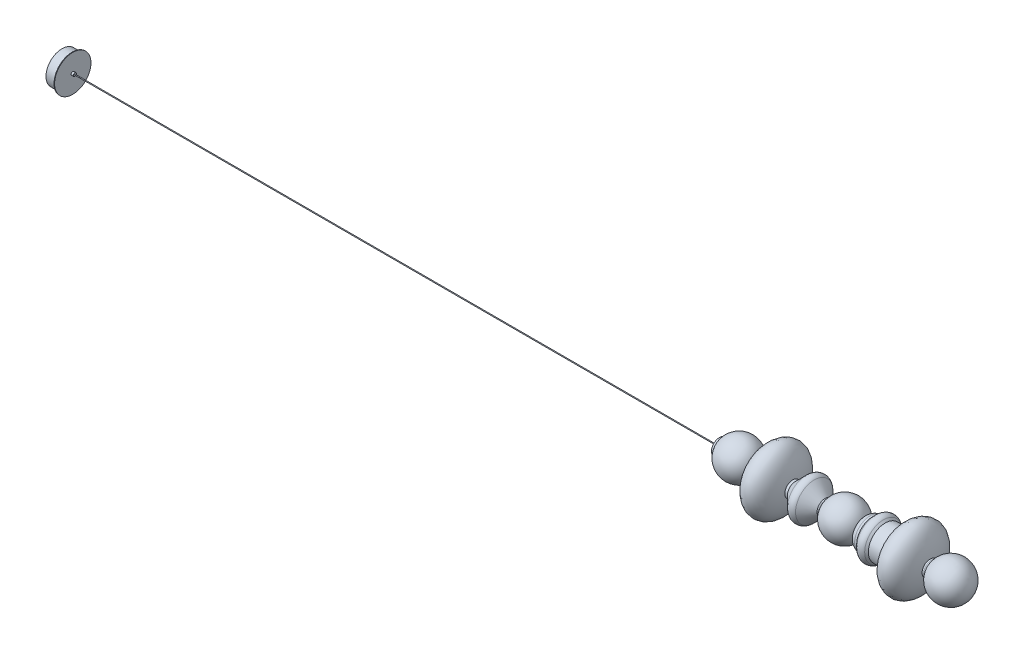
ISO-10303-21;
HEADER;
FILE_DESCRIPTION(('STEP AP214'),'2;1');
FILE_NAME('part.step','',(''),(''),'','','');
FILE_SCHEMA(('AUTOMOTIVE_DESIGN { 1 0 10303 214 1 1 1 1 }'));
ENDSEC;
DATA;
#1=APPLICATION_CONTEXT('core data for automotive mechanical design processes');
#2=APPLICATION_PROTOCOL_DEFINITION('international standard','automotive_design',2000,#1);
#3=PRODUCT_CONTEXT('',#1,'mechanical');
#4=PRODUCT('Part','Part','',(#3));
#5=PRODUCT_RELATED_PRODUCT_CATEGORY('part','',(#4));
#6=PRODUCT_DEFINITION_FORMATION('','',#4);
#7=PRODUCT_DEFINITION_CONTEXT('part definition',#1,'design');
#8=PRODUCT_DEFINITION('design','',#6,#7);
#9=PRODUCT_DEFINITION_SHAPE('','',#8);
#10=(LENGTH_UNIT() NAMED_UNIT(*) SI_UNIT(.MILLI.,.METRE.));
#11=(NAMED_UNIT(*) PLANE_ANGLE_UNIT() SI_UNIT($,.RADIAN.));
#12=(NAMED_UNIT(*) SI_UNIT($,.STERADIAN.) SOLID_ANGLE_UNIT());
#13=UNCERTAINTY_MEASURE_WITH_UNIT(LENGTH_MEASURE(1.E-05),#10,'distance_accuracy_value','');
#14=(GEOMETRIC_REPRESENTATION_CONTEXT(3) GLOBAL_UNCERTAINTY_ASSIGNED_CONTEXT((#13)) GLOBAL_UNIT_ASSIGNED_CONTEXT((#10,
#11,#12)) REPRESENTATION_CONTEXT('',''));
#15=CARTESIAN_POINT('',(0.,0.,0.));
#16=DIRECTION('',(0.,0.,1.));
#17=DIRECTION('',(1.,0.,0.));
#18=AXIS2_PLACEMENT_3D('',#15,#16,#17);
#19=CARTESIAN_POINT('',(-585.624200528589,0.,0.));
#20=DIRECTION('',(1.,0.,0.));
#21=DIRECTION('',(0.,0.,-1.));
#22=AXIS2_PLACEMENT_3D('',#19,#20,#21);
#23=PLANE('',#22);
#24=CARTESIAN_POINT('',(-585.624200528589,0.,0.));
#25=DIRECTION('',(-1.,0.,0.));
#26=DIRECTION('',(0.,0.,1.));
#27=AXIS2_PLACEMENT_3D('',#24,#25,#26);
#28=CIRCLE('',#27,6.);
#29=CARTESIAN_POINT('',(-585.624200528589,0.,6.));
#30=VERTEX_POINT('',#29);
#31=EDGE_CURVE('E66',#30,#30,#28,.T.);
#32=ORIENTED_EDGE('',*,*,#31,.F.);
#33=EDGE_LOOP('',(#32));
#34=FACE_BOUND('',#33,.T.);
#35=CARTESIAN_POINT('',(-585.624200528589,0.,0.));
#36=DIRECTION('',(-1.,0.,0.));
#37=DIRECTION('',(0.,0.,1.));
#38=AXIS2_PLACEMENT_3D('',#35,#36,#37);
#39=CIRCLE('',#38,37.);
#40=CARTESIAN_POINT('',(-585.624200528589,0.,37.));
#41=VERTEX_POINT('',#40);
#42=EDGE_CURVE('E57',#41,#41,#39,.T.);
#43=ORIENTED_EDGE('',*,*,#42,.T.);
#44=EDGE_LOOP('',(#43));
#45=FACE_BOUND('',#44,.T.);
#46=ADVANCED_FACE('F54',(#34,#45),#23,.F.);
#47=CARTESIAN_POINT('',(-986.248401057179,0.,0.));
#48=DIRECTION('',(-1.,0.,0.));
#49=DIRECTION('',(0.,0.,1.));
#50=AXIS2_PLACEMENT_3D('',#47,#48,#49);
#51=CYLINDRICAL_SURFACE('',#50,37.);
#52=ORIENTED_EDGE('',*,*,#42,.F.);
#53=EDGE_LOOP('',(#52));
#54=FACE_BOUND('',#53,.T.);
#55=CARTESIAN_POINT('',(-575.624200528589,0.,0.));
#56=DIRECTION('',(-1.,0.,0.));
#57=DIRECTION('',(0.,0.,1.));
#58=AXIS2_PLACEMENT_3D('',#55,#56,#57);
#59=CIRCLE('',#58,37.);
#60=CARTESIAN_POINT('',(-575.624200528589,0.,37.));
#61=VERTEX_POINT('',#60);
#62=EDGE_CURVE('E89',#61,#61,#59,.T.);
#63=ORIENTED_EDGE('',*,*,#62,.T.);
#64=EDGE_LOOP('',(#63));
#65=FACE_BOUND('',#64,.T.);
#66=ADVANCED_FACE('F98',(#54,#65),#51,.T.);
#67=CARTESIAN_POINT('',(-575.624200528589,0.,0.));
#68=DIRECTION('',(-1.,0.,0.));
#69=DIRECTION('',(0.,0.,1.));
#70=AXIS2_PLACEMENT_3D('',#67,#68,#69);
#71=PLANE('',#70);
#72=ORIENTED_EDGE('',*,*,#62,.F.);
#73=EDGE_LOOP('',(#72));
#74=FACE_BOUND('',#73,.T.);
#75=ADVANCED_FACE('F100',(#74),#71,.F.);
#76=CARTESIAN_POINT('',(-595.624200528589,0.,0.));
#77=DIRECTION('',(1.,0.,0.));
#78=DIRECTION('',(0.,0.,-1.));
#79=AXIS2_PLACEMENT_3D('',#76,#77,#78);
#80=CYLINDRICAL_SURFACE('',#79,6.);
#81=CARTESIAN_POINT('',(-595.624200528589,0.,0.));
#82=DIRECTION('',(-1.,0.,0.));
#83=DIRECTION('',(0.,0.,1.));
#84=AXIS2_PLACEMENT_3D('',#81,#82,#83);
#85=CIRCLE('',#84,6.);
#86=CARTESIAN_POINT('',(-595.624200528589,0.,6.));
#87=VERTEX_POINT('',#86);
#88=EDGE_CURVE('E85',#87,#87,#85,.T.);
#89=ORIENTED_EDGE('',*,*,#88,.F.);
#90=EDGE_LOOP('',(#89));
#91=FACE_BOUND('',#90,.T.);
#92=ORIENTED_EDGE('',*,*,#31,.T.);
#93=EDGE_LOOP('',(#92));
#94=FACE_BOUND('',#93,.T.);
#95=ADVANCED_FACE('F105',(#91,#94),#80,.T.);
#96=CARTESIAN_POINT('',(-595.624200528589,0.,0.));
#97=DIRECTION('',(-1.,0.,0.));
#98=DIRECTION('',(0.,0.,1.));
#99=AXIS2_PLACEMENT_3D('',#96,#97,#98);
#100=PLANE('',#99);
#101=CARTESIAN_POINT('',(-595.624200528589,0.,0.));
#102=DIRECTION('',(-1.,0.,0.));
#103=DIRECTION('',(0.,0.,1.));
#104=AXIS2_PLACEMENT_3D('',#101,#102,#103);
#105=CIRCLE('',#104,1.75);
#106=CARTESIAN_POINT('',(-595.624200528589,0.,1.75));
#107=VERTEX_POINT('',#106);
#108=EDGE_CURVE('E61',#107,#107,#105,.T.);
#109=ORIENTED_EDGE('',*,*,#108,.F.);
#110=EDGE_LOOP('',(#109));
#111=FACE_BOUND('',#110,.T.);
#112=ORIENTED_EDGE('',*,*,#88,.T.);
#113=EDGE_LOOP('',(#112));
#114=FACE_BOUND('',#113,.T.);
#115=ADVANCED_FACE('F112',(#111,#114),#100,.T.);
#116=CARTESIAN_POINT('',(-3595.62420052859,0.,0.));
#117=DIRECTION('',(1.,0.,0.));
#118=DIRECTION('',(0.,0.,-1.));
#119=AXIS2_PLACEMENT_3D('',#116,#117,#118);
#120=CYLINDRICAL_SURFACE('',#119,1.75);
#121=CARTESIAN_POINT('',(-3595.62420052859,0.,0.));
#122=DIRECTION('',(-1.,0.,0.));
#123=DIRECTION('',(0.,0.,1.));
#124=AXIS2_PLACEMENT_3D('',#121,#122,#123);
#125=CIRCLE('',#124,1.75);
#126=CARTESIAN_POINT('',(-3595.62420052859,0.,1.75));
#127=VERTEX_POINT('',#126);
#128=EDGE_CURVE('E81',#127,#127,#125,.T.);
#129=ORIENTED_EDGE('',*,*,#128,.F.);
#130=EDGE_LOOP('',(#129));
#131=FACE_BOUND('',#130,.T.);
#132=ORIENTED_EDGE('',*,*,#108,.T.);
#133=EDGE_LOOP('',(#132));
#134=FACE_BOUND('',#133,.T.);
#135=ADVANCED_FACE('F116',(#131,#134),#120,.T.);
#136=CARTESIAN_POINT('',(-3605.62420052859,0.,0.));
#137=DIRECTION('',(1.,0.,0.));
#138=DIRECTION('',(0.,0.,-1.));
#139=AXIS2_PLACEMENT_3D('',#136,#137,#138);
#140=CYLINDRICAL_SURFACE('',#139,7.5);
#141=CARTESIAN_POINT('',(-3605.62420052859,0.,0.));
#142=DIRECTION('',(-1.,0.,0.));
#143=DIRECTION('',(0.,0.,1.));
#144=AXIS2_PLACEMENT_3D('',#141,#142,#143);
#145=CIRCLE('',#144,7.5);
#146=CARTESIAN_POINT('',(-3605.62420052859,0.,7.5));
#147=VERTEX_POINT('',#146);
#148=EDGE_CURVE('E78',#147,#147,#145,.T.);
#149=ORIENTED_EDGE('',*,*,#148,.F.);
#150=EDGE_LOOP('',(#149));
#151=FACE_BOUND('',#150,.T.);
#152=CARTESIAN_POINT('',(-3595.62420052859,0.,0.));
#153=DIRECTION('',(-1.,0.,0.));
#154=DIRECTION('',(0.,0.,1.));
#155=AXIS2_PLACEMENT_3D('',#152,#153,#154);
#156=CIRCLE('',#155,7.5);
#157=CARTESIAN_POINT('',(-3595.62420052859,0.,7.5));
#158=VERTEX_POINT('',#157);
#159=EDGE_CURVE('E74',#158,#158,#156,.T.);
#160=ORIENTED_EDGE('',*,*,#159,.T.);
#161=EDGE_LOOP('',(#160));
#162=FACE_BOUND('',#161,.T.);
#163=ADVANCED_FACE('F120',(#151,#162),#140,.T.);
#164=CARTESIAN_POINT('',(-3595.62420052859,0.,0.));
#165=DIRECTION('',(-1.,0.,0.));
#166=DIRECTION('',(0.,0.,1.));
#167=AXIS2_PLACEMENT_3D('',#164,#165,#166);
#168=PLANE('',#167);
#169=ORIENTED_EDGE('',*,*,#128,.T.);
#170=EDGE_LOOP('',(#169));
#171=FACE_BOUND('',#170,.T.);
#172=ORIENTED_EDGE('',*,*,#159,.F.);
#173=EDGE_LOOP('',(#172));
#174=FACE_BOUND('',#173,.T.);
#175=ADVANCED_FACE('F124',(#171,#174),#168,.F.);
#176=CARTESIAN_POINT('',(-3608.16420052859,0.,0.));
#177=DIRECTION('',(1.,0.,0.));
#178=DIRECTION('',(0.,0.,-1.));
#179=AXIS2_PLACEMENT_3D('',#176,#177,#178);
#180=CYLINDRICAL_SURFACE('',#179,84.963);
#181=CARTESIAN_POINT('',(-3608.16420052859,0.,0.));
#182=DIRECTION('',(-1.,0.,0.));
#183=DIRECTION('',(0.,0.,1.));
#184=AXIS2_PLACEMENT_3D('',#181,#182,#183);
#185=CIRCLE('',#184,84.963);
#186=CARTESIAN_POINT('',(-3608.16420052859,0.,84.963));
#187=VERTEX_POINT('',#186);
#188=EDGE_CURVE('E71',#187,#187,#185,.T.);
#189=ORIENTED_EDGE('',*,*,#188,.F.);
#190=EDGE_LOOP('',(#189));
#191=FACE_BOUND('',#190,.T.);
#192=CARTESIAN_POINT('',(-3605.62420052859,0.,0.));
#193=DIRECTION('',(-1.,0.,0.));
#194=DIRECTION('',(0.,0.,1.));
#195=AXIS2_PLACEMENT_3D('',#192,#193,#194);
#196=CIRCLE('',#195,84.963);
#197=CARTESIAN_POINT('',(-3605.62420052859,0.,84.963));
#198=VERTEX_POINT('',#197);
#199=EDGE_CURVE('E75',#198,#198,#196,.T.);
#200=ORIENTED_EDGE('',*,*,#199,.T.);
#201=EDGE_LOOP('',(#200));
#202=FACE_BOUND('',#201,.T.);
#203=ADVANCED_FACE('F128',(#191,#202),#180,.T.);
#204=CARTESIAN_POINT('',(-3608.16420052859,0.,0.));
#205=DIRECTION('',(-1.,0.,0.));
#206=DIRECTION('',(0.,0.,1.));
#207=AXIS2_PLACEMENT_3D('',#204,#205,#206);
#208=PLANE('',#207);
#209=CARTESIAN_POINT('',(-3608.16420052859,0.,0.));
#210=DIRECTION('',(-1.,0.,0.));
#211=DIRECTION('',(0.,0.,1.));
#212=AXIS2_PLACEMENT_3D('',#209,#210,#211);
#213=CIRCLE('',#212,75.057);
#214=CARTESIAN_POINT('',(-3608.16420052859,0.,-75.057));
#215=VERTEX_POINT('',#214);
#216=EDGE_CURVE('E11',#215,#215,#213,.T.);
#217=ORIENTED_EDGE('',*,*,#216,.F.);
#218=EDGE_LOOP('',(#217));
#219=FACE_BOUND('',#218,.T.);
#220=ORIENTED_EDGE('',*,*,#188,.T.);
#221=EDGE_LOOP('',(#220));
#222=FACE_BOUND('',#221,.T.);
#223=ADVANCED_FACE('F132',(#219,#222),#208,.T.);
#224=CARTESIAN_POINT('',(-3605.62420052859,0.,0.));
#225=DIRECTION('',(-1.,0.,0.));
#226=DIRECTION('',(0.,0.,1.));
#227=AXIS2_PLACEMENT_3D('',#224,#225,#226);
#228=PLANE('',#227);
#229=ORIENTED_EDGE('',*,*,#148,.T.);
#230=EDGE_LOOP('',(#229));
#231=FACE_BOUND('',#230,.T.);
#232=ORIENTED_EDGE('',*,*,#199,.F.);
#233=EDGE_LOOP('',(#232));
#234=FACE_BOUND('',#233,.T.);
#235=ADVANCED_FACE('F134',(#231,#234),#228,.F.);
#236=CARTESIAN_POINT('',(-3655.66220052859,0.,0.));
#237=DIRECTION('',(1.,0.,0.));
#238=DIRECTION('',(0.,0.,-1.));
#239=AXIS2_PLACEMENT_3D('',#236,#237,#238);
#240=CYLINDRICAL_SURFACE('',#239,75.057);
#241=CARTESIAN_POINT('',(-3655.66220052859,0.,0.));
#242=DIRECTION('',(-1.,0.,0.));
#243=DIRECTION('',(0.,0.,1.));
#244=AXIS2_PLACEMENT_3D('',#241,#242,#243);
#245=CIRCLE('',#244,75.057);
#246=CARTESIAN_POINT('',(-3655.66220052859,0.,-75.057));
#247=VERTEX_POINT('',#246);
#248=EDGE_CURVE('E70',#247,#247,#245,.T.);
#249=CARTESIAN_POINT('',(-3655.66220052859,0.,-75.057));
#250=CARTESIAN_POINT('',(-3655.16742969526,0.,-75.057));
#251=CARTESIAN_POINT('',(-3654.67265886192,0.,-75.057));
#252=CARTESIAN_POINT('',(-3653.68311719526,0.,-75.057));
#253=CARTESIAN_POINT('',(-3653.18834636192,0.,-75.057));
#254=CARTESIAN_POINT('',(-3652.19880469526,0.,-75.057));
#255=CARTESIAN_POINT('',(-3651.70403386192,0.,-75.057));
#256=CARTESIAN_POINT('',(-3650.71449219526,0.,-75.057));
#257=CARTESIAN_POINT('',(-3650.21972136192,0.,-75.057));
#258=CARTESIAN_POINT('',(-3649.23017969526,0.,-75.057));
#259=CARTESIAN_POINT('',(-3648.73540886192,0.,-75.057));
#260=CARTESIAN_POINT('',(-3647.74586719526,0.,-75.057));
#261=CARTESIAN_POINT('',(-3647.25109636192,0.,-75.057));
#262=CARTESIAN_POINT('',(-3646.26155469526,0.,-75.057));
#263=CARTESIAN_POINT('',(-3645.76678386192,0.,-75.057));
#264=CARTESIAN_POINT('',(-3644.77724219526,0.,-75.057));
#265=CARTESIAN_POINT('',(-3644.28247136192,0.,-75.057));
#266=CARTESIAN_POINT('',(-3643.29292969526,0.,-75.057));
#267=CARTESIAN_POINT('',(-3642.79815886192,0.,-75.057));
#268=CARTESIAN_POINT('',(-3641.80861719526,0.,-75.057));
#269=CARTESIAN_POINT('',(-3641.31384636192,0.,-75.057));
#270=CARTESIAN_POINT('',(-3640.32430469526,0.,-75.057));
#271=CARTESIAN_POINT('',(-3639.82953386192,0.,-75.057));
#272=CARTESIAN_POINT('',(-3638.83999219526,0.,-75.057));
#273=CARTESIAN_POINT('',(-3638.34522136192,0.,-75.057));
#274=CARTESIAN_POINT('',(-3637.35567969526,0.,-75.057));
#275=CARTESIAN_POINT('',(-3636.86090886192,0.,-75.057));
#276=CARTESIAN_POINT('',(-3635.87136719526,0.,-75.057));
#277=CARTESIAN_POINT('',(-3635.37659636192,0.,-75.057));
#278=CARTESIAN_POINT('',(-3634.38705469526,0.,-75.057));
#279=CARTESIAN_POINT('',(-3633.89228386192,0.,-75.057));
#280=CARTESIAN_POINT('',(-3632.90274219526,0.,-75.057));
#281=CARTESIAN_POINT('',(-3632.40797136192,0.,-75.057));
#282=CARTESIAN_POINT('',(-3631.41842969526,0.,-75.057));
#283=CARTESIAN_POINT('',(-3630.92365886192,0.,-75.057));
#284=CARTESIAN_POINT('',(-3629.93411719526,0.,-75.057));
#285=CARTESIAN_POINT('',(-3629.43934636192,0.,-75.057));
#286=CARTESIAN_POINT('',(-3628.44980469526,0.,-75.057));
#287=CARTESIAN_POINT('',(-3627.95503386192,0.,-75.057));
#288=CARTESIAN_POINT('',(-3626.96549219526,0.,-75.057));
#289=CARTESIAN_POINT('',(-3626.47072136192,0.,-75.057));
#290=CARTESIAN_POINT('',(-3625.48117969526,0.,-75.057));
#291=CARTESIAN_POINT('',(-3624.98640886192,0.,-75.057));
#292=CARTESIAN_POINT('',(-3623.99686719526,0.,-75.057));
#293=CARTESIAN_POINT('',(-3623.50209636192,0.,-75.057));
#294=CARTESIAN_POINT('',(-3622.51255469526,0.,-75.057));
#295=CARTESIAN_POINT('',(-3622.01778386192,0.,-75.057));
#296=CARTESIAN_POINT('',(-3621.02824219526,0.,-75.057));
#297=CARTESIAN_POINT('',(-3620.53347136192,0.,-75.057));
#298=CARTESIAN_POINT('',(-3619.54392969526,0.,-75.057));
#299=CARTESIAN_POINT('',(-3619.04915886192,0.,-75.057));
#300=CARTESIAN_POINT('',(-3618.05961719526,0.,-75.057));
#301=CARTESIAN_POINT('',(-3617.56484636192,0.,-75.057));
#302=CARTESIAN_POINT('',(-3616.57530469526,0.,-75.057));
#303=CARTESIAN_POINT('',(-3616.08053386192,0.,-75.057));
#304=CARTESIAN_POINT('',(-3615.09099219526,0.,-75.057));
#305=CARTESIAN_POINT('',(-3614.59622136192,0.,-75.057));
#306=CARTESIAN_POINT('',(-3613.60667969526,0.,-75.057));
#307=CARTESIAN_POINT('',(-3613.11190886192,0.,-75.057));
#308=CARTESIAN_POINT('',(-3612.12236719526,0.,-75.057));
#309=CARTESIAN_POINT('',(-3611.62759636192,0.,-75.057));
#310=CARTESIAN_POINT('',(-3610.63805469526,0.,-75.057));
#311=CARTESIAN_POINT('',(-3610.14328386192,0.,-75.057));
#312=CARTESIAN_POINT('',(-3609.15374219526,0.,-75.057));
#313=CARTESIAN_POINT('',(-3608.65897136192,0.,-75.057));
#314=CARTESIAN_POINT('',(-3608.16420052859,0.,-75.057));
#315=B_SPLINE_CURVE_WITH_KNOTS('',3,(#249,#250,#251,#252,#253,#254,#255,#256,#257,#258,#259,
#260,#261,#262,#263,#264,#265,#266,#267,#268,#269,#270,#271,#272,#273,#274,#275,#276,#277,#278,
#279,#280,#281,#282,#283,#284,#285,#286,#287,#288,#289,#290,#291,#292,#293,#294,#295,#296,#297,
#298,#299,#300,#301,#302,#303,#304,#305,#306,#307,#308,#309,#310,#311,#312,#313,#314),
.UNSPECIFIED.,.F.,.F.,(4,2,2,2,2,2,2,2,2,2,2,2,2,2,2,2,2,2,2,2,2,2,2,2,2,2,2,2,2,2,2,2,4),(0.,
1.4843124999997,2.96862499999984,4.45293749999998,5.93724999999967,7.42156249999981,
8.90587499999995,10.3901874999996,11.8744999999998,13.3588124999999,14.8431249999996,
16.3274374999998,17.8117499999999,19.2960624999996,20.7803749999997,22.2646874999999,
23.7489999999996,25.2333124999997,26.7176249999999,28.2019375,29.6862499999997,31.1705624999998,
32.654875,34.1391874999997,35.6234999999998,37.1078125,38.5921249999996,40.0764374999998,
41.5607499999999,43.0450624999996,44.5293749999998,46.0136874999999,47.4979999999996),.UNSPECIFIED.);
#316=EDGE_CURVE('BSEAM137',#247,#215,#315,.T.);
#317=ORIENTED_EDGE('',*,*,#248,.F.);
#318=ORIENTED_EDGE('',*,*,#216,.T.);
#319=ORIENTED_EDGE('',*,*,#316,.T.);
#320=ORIENTED_EDGE('',*,*,#316,.F.);
#321=EDGE_LOOP('',(#317,#319,#318,#320));
#322=FACE_BOUND('',#321,.T.);
#323=ADVANCED_FACE('F137',(#322),#240,.T.);
#324=CARTESIAN_POINT('',(-3655.66220052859,0.,0.));
#325=DIRECTION('',(-1.,0.,0.));
#326=DIRECTION('',(0.,0.,1.));
#327=AXIS2_PLACEMENT_3D('',#324,#325,#326);
#328=PLANE('',#327);
#329=ORIENTED_EDGE('',*,*,#248,.T.);
#330=EDGE_LOOP('',(#329));
#331=FACE_BOUND('',#330,.T.);
#332=ADVANCED_FACE('F144',(#331),#328,.T.);
#333=CLOSED_SHELL('',(#46,#66,#75,#95,#115,#135,#163,#175,#203,#223,#235,#323,#332));
#334=MANIFOLD_SOLID_BREP('B2',#333);
#335=CARTESIAN_POINT('',(-575.624200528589,35.9687364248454,0.));
#336=DIRECTION('',(1.,0.,0.));
#337=DIRECTION('',(0.,-1.,0.));
#338=AXIS2_PLACEMENT_3D('',#335,#336,#337);
#339=PLANE('',#338);
#340=CARTESIAN_POINT('',(-575.624200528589,0.,0.));
#341=DIRECTION('',(-1.,0.,0.));
#342=DIRECTION('',(0.,-1.,0.));
#343=AXIS2_PLACEMENT_3D('',#340,#341,#342);
#344=CIRCLE('',#343,35.9687364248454);
#345=CARTESIAN_POINT('',(-575.624200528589,35.9687364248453,0.));
#346=VERTEX_POINT('',#345);
#347=EDGE_CURVE('E53',#346,#346,#344,.T.);
#348=ORIENTED_EDGE('',*,*,#347,.T.);
#349=EDGE_LOOP('',(#348));
#350=FACE_BOUND('',#349,.T.);
#351=ADVANCED_FACE('F265',(#350),#339,.F.);
#352=CARTESIAN_POINT('',(-493.124200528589,0.,0.));
#353=DIRECTION('',(1.,0.,0.));
#354=DIRECTION('',(0.,1.,0.));
#355=AXIS2_PLACEMENT_3D('',#352,#353,#354);
#356=SPHERICAL_SURFACE('',#355,90.);
#357=CARTESIAN_POINT('',(-410.624200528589,0.,0.));
#358=DIRECTION('',(-1.,0.,0.));
#359=DIRECTION('',(0.,-1.,0.));
#360=AXIS2_PLACEMENT_3D('',#357,#358,#359);
#361=CIRCLE('',#360,35.9687364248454);
#362=CARTESIAN_POINT('',(-410.624200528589,35.9687364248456,0.));
#363=VERTEX_POINT('',#362);
#364=EDGE_CURVE('E271',#363,#363,#361,.T.);
#365=CARTESIAN_POINT('',(-410.624200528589,35.9687364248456,0.));
#366=CARTESIAN_POINT('',(-411.058686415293,36.9653219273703,0.));
#367=CARTESIAN_POINT('',(-411.511246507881,37.9540267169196,0.));
#368=CARTESIAN_POINT('',(-412.451884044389,39.9143942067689,0.));
#369=CARTESIAN_POINT('',(-412.939961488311,40.8860569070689,0.));
#370=CARTESIAN_POINT('',(-413.951002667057,42.811059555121,0.));
#371=CARTESIAN_POINT('',(-414.47396640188,43.7643995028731,0.));
#372=CARTESIAN_POINT('',(-415.554090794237,45.6515060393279,0.));
#373=CARTESIAN_POINT('',(-416.11125145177,46.5852726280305,0.));
#374=CARTESIAN_POINT('',(-417.25903876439,48.4320059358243,0.));
#375=CARTESIAN_POINT('',(-417.849665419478,49.3449726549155,0.));
#376=CARTESIAN_POINT('',(-419.063608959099,51.148907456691,0.));
#377=CARTESIAN_POINT('',(-419.686925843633,52.0398755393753,0.));
#378=CARTESIAN_POINT('',(-420.965431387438,53.7986430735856,0.));
#379=CARTESIAN_POINT('',(-421.62062004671,54.6664425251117,0.));
#380=CARTESIAN_POINT('',(-422.9620087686,56.3777332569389,0.));
#381=CARTESIAN_POINT('',(-423.648208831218,57.2212245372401,0.));
#382=CARTESIAN_POINT('',(-425.050719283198,58.8827912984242,0.));
#383=CARTESIAN_POINT('',(-425.767029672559,59.7008667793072,0.));
#384=CARTESIAN_POINT('',(-427.228820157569,61.3105276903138,0.));
#385=CARTESIAN_POINT('',(-427.974300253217,62.1021131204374,0.));
#386=CARTESIAN_POINT('',(-429.493451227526,63.6577544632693,0.));
#387=CARTESIAN_POINT('',(-430.267122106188,64.4218103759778,0.));
#388=CARTESIAN_POINT('',(-431.841638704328,65.9213893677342,0.));
#389=CARTESIAN_POINT('',(-432.642484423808,66.6569124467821,0.));
#390=CARTESIAN_POINT('',(-434.27029907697,68.0984599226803,0.));
#391=CARTESIAN_POINT('',(-435.097268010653,68.8044843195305,0.));
#392=CARTESIAN_POINT('',(-436.776243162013,70.1861073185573,0.));
#393=CARTESIAN_POINT('',(-437.62824937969,70.8617059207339,0.));
#394=CARTESIAN_POINT('',(-439.356180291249,72.1815901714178,0.));
#395=CARTESIAN_POINT('',(-440.23210498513,72.8258758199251,0.));
#396=CARTESIAN_POINT('',(-442.006722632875,74.0822881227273,0.));
#397=CARTESIAN_POINT('',(-442.90541558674,74.6944147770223,0.));
#398=CARTESIAN_POINT('',(-444.724389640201,75.8857052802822,0.));
#399=CARTESIAN_POINT('',(-445.644670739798,76.4648691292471,0.));
#400=CARTESIAN_POINT('',(-447.505612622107,77.5894734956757,0.));
#401=CARTESIAN_POINT('',(-448.446273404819,78.1349140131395,0.));
#402=CARTESIAN_POINT('',(-450.34673942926,79.191355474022,0.));
#403=CARTESIAN_POINT('',(-451.306544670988,79.7023564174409,0.));
#404=CARTESIAN_POINT('',(-453.244039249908,80.6892477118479,0.));
#405=CARTESIAN_POINT('',(-454.221728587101,81.1651380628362,0.));
#406=CARTESIAN_POINT('',(-456.193707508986,82.0811832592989,0.));
#407=CARTESIAN_POINT('',(-457.187997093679,82.5213381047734,0.));
#408=CARTESIAN_POINT('',(-459.191870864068,83.3653343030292,0.));
#409=CARTESIAN_POINT('',(-460.201455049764,83.7691756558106,0.));
#410=CARTESIAN_POINT('',(-462.23459229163,84.5400145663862,0.));
#411=CARTESIAN_POINT('',(-463.258145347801,84.9070121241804,0.));
#412=CARTESIAN_POINT('',(-465.317876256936,85.6036815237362,0.));
#413=CARTESIAN_POINT('',(-466.3540541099,85.9333533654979,0.));
#414=CARTESIAN_POINT('',(-468.437673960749,86.5549384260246,0.));
#415=CARTESIAN_POINT('',(-469.485115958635,86.8468516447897,0.));
#416=CARTESIAN_POINT('',(-471.589888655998,87.3925361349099,0.));
#417=CARTESIAN_POINT('',(-472.647219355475,87.6463074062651,0.));
#418=CARTESIAN_POINT('',(-474.770381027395,88.1153747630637,0.));
#419=CARTESIAN_POINT('',(-475.836211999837,88.3306708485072,0.));
#420=CARTESIAN_POINT('',(-477.974974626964,88.7225051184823,0.));
#421=CARTESIAN_POINT('',(-479.047906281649,88.899043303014,0.));
#422=CARTESIAN_POINT('',(-481.199461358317,89.2131299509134,0.));
#423=CARTESIAN_POINT('',(-482.278084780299,89.3506784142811,0.));
#424=CARTESIAN_POINT('',(-484.439607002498,89.5866049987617,0.));
#425=CARTESIAN_POINT('',(-485.522505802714,89.6849831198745,0.));
#426=CARTESIAN_POINT('',(-487.691156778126,89.8424398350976,0.));
#427=CARTESIAN_POINT('',(-488.776908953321,89.9015184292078,0.));
#428=CARTESIAN_POINT('',(-490.949840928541,89.980298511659,0.));
#429=CARTESIAN_POINT('',(-492.037020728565,90.,0.));
#430=CARTESIAN_POINT('',(-494.211380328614,90.,0.));
#431=CARTESIAN_POINT('',(-495.298560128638,89.980298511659,0.));
#432=CARTESIAN_POINT('',(-497.471492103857,89.9015184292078,0.));
#433=CARTESIAN_POINT('',(-498.557244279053,89.8424398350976,0.));
#434=CARTESIAN_POINT('',(-500.725895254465,89.6849831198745,0.));
#435=CARTESIAN_POINT('',(-501.808794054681,89.5866049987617,0.));
#436=CARTESIAN_POINT('',(-503.970316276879,89.3506784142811,0.));
#437=CARTESIAN_POINT('',(-505.048939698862,89.2131299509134,0.));
#438=CARTESIAN_POINT('',(-507.200494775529,88.8990433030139,0.));
#439=CARTESIAN_POINT('',(-508.273426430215,88.7225051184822,0.));
#440=CARTESIAN_POINT('',(-510.412189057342,88.3306708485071,0.));
#441=CARTESIAN_POINT('',(-511.478020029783,88.1153747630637,0.));
#442=CARTESIAN_POINT('',(-513.601181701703,87.6463074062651,0.));
#443=CARTESIAN_POINT('',(-514.658512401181,87.3925361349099,0.));
#444=CARTESIAN_POINT('',(-516.763285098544,86.8468516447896,0.));
#445=CARTESIAN_POINT('',(-517.810727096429,86.5549384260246,0.));
#446=CARTESIAN_POINT('',(-519.894346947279,85.9333533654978,0.));
#447=CARTESIAN_POINT('',(-520.930524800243,85.6036815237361,0.));
#448=CARTESIAN_POINT('',(-522.990255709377,84.9070121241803,0.));
#449=CARTESIAN_POINT('',(-524.013808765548,84.5400145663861,0.));
#450=CARTESIAN_POINT('',(-526.046946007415,83.7691756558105,0.));
#451=CARTESIAN_POINT('',(-527.056530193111,83.3653343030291,0.));
#452=CARTESIAN_POINT('',(-529.0604039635,82.5213381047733,0.));
#453=CARTESIAN_POINT('',(-530.054693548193,82.0811832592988,0.));
#454=CARTESIAN_POINT('',(-532.026672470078,81.1651380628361,0.));
#455=CARTESIAN_POINT('',(-533.004361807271,80.6892477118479,0.));
#456=CARTESIAN_POINT('',(-534.941856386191,79.7023564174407,0.));
#457=CARTESIAN_POINT('',(-535.901661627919,79.1913554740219,0.));
#458=CARTESIAN_POINT('',(-537.802127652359,78.1349140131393,0.));
#459=CARTESIAN_POINT('',(-538.742788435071,77.5894734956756,0.));
#460=CARTESIAN_POINT('',(-540.60373031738,76.464869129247,0.));
#461=CARTESIAN_POINT('',(-541.524011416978,75.885705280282,0.));
#462=CARTESIAN_POINT('',(-543.342985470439,74.6944147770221,0.));
#463=CARTESIAN_POINT('',(-544.241678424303,74.0822881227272,0.));
#464=CARTESIAN_POINT('',(-546.016296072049,72.825875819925,0.));
#465=CARTESIAN_POINT('',(-546.89222076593,72.1815901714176,0.));
#466=CARTESIAN_POINT('',(-548.620151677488,70.8617059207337,0.));
#467=CARTESIAN_POINT('',(-549.472157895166,70.1861073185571,0.));
#468=CARTESIAN_POINT('',(-551.151133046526,68.8044843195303,0.));
#469=CARTESIAN_POINT('',(-551.978101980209,68.0984599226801,0.));
#470=CARTESIAN_POINT('',(-553.605916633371,66.656912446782,0.));
#471=CARTESIAN_POINT('',(-554.40676235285,65.921389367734,0.));
#472=CARTESIAN_POINT('',(-555.981278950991,64.4218103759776,0.));
#473=CARTESIAN_POINT('',(-556.754949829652,63.6577544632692,0.));
#474=CARTESIAN_POINT('',(-558.274100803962,62.1021131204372,0.));
#475=CARTESIAN_POINT('',(-559.01958089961,61.3105276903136,0.));
#476=CARTESIAN_POINT('',(-560.481371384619,59.700866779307,0.));
#477=CARTESIAN_POINT('',(-561.197681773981,58.882791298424,0.));
#478=CARTESIAN_POINT('',(-562.600192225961,57.2212245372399,0.));
#479=CARTESIAN_POINT('',(-563.286392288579,56.3777332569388,0.));
#480=CARTESIAN_POINT('',(-564.627781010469,54.6664425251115,0.));
#481=CARTESIAN_POINT('',(-565.282969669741,53.7986430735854,0.));
#482=CARTESIAN_POINT('',(-566.561475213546,52.039875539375,0.));
#483=CARTESIAN_POINT('',(-567.18479209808,51.1489074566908,0.));
#484=CARTESIAN_POINT('',(-568.398735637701,49.3449726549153,0.));
#485=CARTESIAN_POINT('',(-568.989362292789,48.4320059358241,0.));
#486=CARTESIAN_POINT('',(-570.137149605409,46.5852726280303,0.));
#487=CARTESIAN_POINT('',(-570.694310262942,45.6515060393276,0.));
#488=CARTESIAN_POINT('',(-571.774434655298,43.7643995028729,0.));
#489=CARTESIAN_POINT('',(-572.297398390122,42.8110595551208,0.));
#490=CARTESIAN_POINT('',(-573.308439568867,40.8860569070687,0.));
#491=CARTESIAN_POINT('',(-573.796517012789,39.9143942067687,0.));
#492=CARTESIAN_POINT('',(-574.737154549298,37.9540267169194,0.));
#493=CARTESIAN_POINT('',(-575.189714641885,36.96532192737,0.));
#494=CARTESIAN_POINT('',(-575.624200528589,35.9687364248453,0.));
#495=B_SPLINE_CURVE_WITH_KNOTS('',3,(#365,#366,#367,#368,#369,#370,#371,#372,#373,#374,#375,
#376,#377,#378,#379,#380,#381,#382,#383,#384,#385,#386,#387,#388,#389,#390,#391,#392,#393,#394,
#395,#396,#397,#398,#399,#400,#401,#402,#403,#404,#405,#406,#407,#408,#409,#410,#411,#412,#413,
#414,#415,#416,#417,#418,#419,#420,#421,#422,#423,#424,#425,#426,#427,#428,#429,#430,#431,#432,
#433,#434,#435,#436,#437,#438,#439,#440,#441,#442,#443,#444,#445,#446,#447,#448,#449,#450,#451,
#452,#453,#454,#455,#456,#457,#458,#459,#460,#461,#462,#463,#464,#465,#466,#467,#468,#469,#470,
#471,#472,#473,#474,#475,#476,#477,#478,#479,#480,#481,#482,#483,#484,#485,#486,#487,#488,#489,
#490,#491,#492,#493,#494),.UNSPECIFIED.,.F.,.F.,(4,2,2,2,2,2,2,2,2,2,2,2,2,2,2,2,2,2,2,2,2,2,2,
2,2,2,2,2,2,2,2,2,2,2,2,2,2,2,2,2,2,2,2,2,2,2,2,2,2,2,2,2,2,2,2,2,2,2,2,2,2,2,2,2,4),(0.,
3.26136096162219,6.52272192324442,9.7840828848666,13.0454438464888,16.306804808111,
19.5681657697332,22.8295267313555,26.0908876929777,29.3522486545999,32.6136096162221,
35.8749705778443,39.1363315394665,42.3976925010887,45.659053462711,48.9204144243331,
52.1817753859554,55.4431363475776,58.7044973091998,61.965858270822,65.2272192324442,
68.4885801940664,71.7499411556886,75.0113021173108,78.272663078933,81.5340240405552,
84.7953850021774,88.0567459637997,91.3181069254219,94.5794678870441,97.8408288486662,
101.102189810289,104.363550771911,107.624911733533,110.886272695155,114.147633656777,
117.4089946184,120.670355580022,123.931716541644,127.193077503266,130.454438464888,
133.715799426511,136.977160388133,140.238521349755,143.499882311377,146.761243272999,
150.022604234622,153.283965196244,156.545326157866,159.806687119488,163.06804808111,
166.329409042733,169.590770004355,172.852130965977,176.113491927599,179.374852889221,
182.636213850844,185.897574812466,189.158935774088,192.42029673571,195.681657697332,
198.943018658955,202.204379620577,205.465740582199,208.727101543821),.UNSPECIFIED.);
#496=EDGE_CURVE('BSEAM277',#363,#346,#495,.T.);
#497=ORIENTED_EDGE('',*,*,#364,.T.);
#498=ORIENTED_EDGE('',*,*,#347,.F.);
#499=ORIENTED_EDGE('',*,*,#496,.T.);
#500=ORIENTED_EDGE('',*,*,#496,.F.);
#501=EDGE_LOOP('',(#497,#499,#498,#500));
#502=FACE_BOUND('',#501,.T.);
#503=ADVANCED_FACE('F277',(#502),#356,.T.);
#504=CARTESIAN_POINT('',(-410.624200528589,35.9687364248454,0.));
#505=DIRECTION('',(-1.,0.,0.));
#506=DIRECTION('',(0.,1.,0.));
#507=AXIS2_PLACEMENT_3D('',#504,#505,#506);
#508=PLANE('',#507);
#509=ORIENTED_EDGE('',*,*,#364,.F.);
#510=EDGE_LOOP('',(#509));
#511=FACE_BOUND('',#510,.T.);
#512=ADVANCED_FACE('F280',(#511),#508,.F.);
#513=CLOSED_SHELL('',(#351,#503,#512));
#514=MANIFOLD_SOLID_BREP('B6',#513);
#515=CARTESIAN_POINT('',(0.,0.,0.));
#516=DIRECTION('',(1.,0.,0.));
#517=DIRECTION('',(0.,0.,1.));
#518=AXIS2_PLACEMENT_3D('',#515,#516,#517);
#519=CYLINDRICAL_SURFACE('',#518,37.);
#520=CARTESIAN_POINT('',(-398.028030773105,0.,0.));
#521=DIRECTION('',(1.,0.,0.));
#522=DIRECTION('',(0.,0.,-1.));
#523=AXIS2_PLACEMENT_3D('',#520,#521,#522);
#524=CIRCLE('',#523,37.);
#525=CARTESIAN_POINT('',(-398.028030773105,0.,-37.));
#526=VERTEX_POINT('',#525);
#527=EDGE_CURVE('E338',#526,#526,#524,.T.);
#528=ORIENTED_EDGE('',*,*,#527,.F.);
#529=EDGE_LOOP('',(#528));
#530=FACE_BOUND('',#529,.T.);
#531=CARTESIAN_POINT('',(-404.326115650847,0.,0.));
#532=DIRECTION('',(-1.,0.,0.));
#533=DIRECTION('',(0.,0.,1.));
#534=AXIS2_PLACEMENT_3D('',#531,#532,#533);
#535=CIRCLE('',#534,37.);
#536=CARTESIAN_POINT('',(-404.326115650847,0.,37.));
#537=VERTEX_POINT('',#536);
#538=CARTESIAN_POINT('',(-404.326115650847,0.,-37.));
#539=VERTEX_POINT('',#538);
#540=EDGE_CURVE('E263',#537,#539,#535,.T.);
#541=ORIENTED_EDGE('',*,*,#540,.F.);
#542=EDGE_CURVE('E320',#539,#537,#535,.T.);
#543=ORIENTED_EDGE('',*,*,#542,.F.);
#544=EDGE_LOOP('',(#541,#543));
#545=FACE_BOUND('',#544,.T.);
#546=ADVANCED_FACE('F316',(#530,#545),#519,.T.);
#547=ORIENTED_EDGE('',*,*,#542,.T.);
#548=ORIENTED_EDGE('',*,*,#540,.T.);
#549=EDGE_LOOP('',(#547,#548));
#550=FACE_BOUND('',#549,.T.);
#551=CARTESIAN_POINT('',(-410.624200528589,0.,0.));
#552=DIRECTION('',(-1.,0.,0.));
#553=DIRECTION('',(0.,0.,1.));
#554=AXIS2_PLACEMENT_3D('',#551,#552,#553);
#555=CIRCLE('',#554,37.);
#556=CARTESIAN_POINT('',(-410.624200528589,0.,37.));
#557=VERTEX_POINT('',#556);
#558=EDGE_CURVE('E334',#557,#557,#555,.T.);
#559=ORIENTED_EDGE('',*,*,#558,.F.);
#560=EDGE_LOOP('',(#559));
#561=FACE_BOUND('',#560,.T.);
#562=ADVANCED_FACE('F318',(#550,#561),#519,.T.);
#563=CARTESIAN_POINT('',(-410.624200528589,0.,0.));
#564=DIRECTION('',(1.,0.,0.));
#565=DIRECTION('',(0.,0.,1.));
#566=AXIS2_PLACEMENT_3D('',#563,#564,#565);
#567=PLANE('',#566);
#568=ORIENTED_EDGE('',*,*,#558,.T.);
#569=EDGE_LOOP('',(#568));
#570=FACE_BOUND('',#569,.T.);
#571=ADVANCED_FACE('F355',(#570),#567,.F.);
#572=CARTESIAN_POINT('',(-320.5,0.,0.));
#573=DIRECTION('',(0.,0.,-1.));
#574=DIRECTION('',(0.,1.,0.));
#575=AXIS2_PLACEMENT_3D('',#572,#573,#574);
#576=ELLIPSE('',#575,150.,80.);
#577=TRIMMED_CURVE('',#576,(PARAMETER_VALUE(4.71238898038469)),
(PARAMETER_VALUE(7.85398163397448)),.T.,.PARAMETER.);
#578=CARTESIAN_POINT('',(0.,0.,0.));
#579=DIRECTION('',(1.,0.,0.));
#580=AXIS1_PLACEMENT('',#578,#579);
#581=SURFACE_OF_REVOLUTION('',#577,#580);
#582=CARTESIAN_POINT('',(-242.971969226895,0.,0.));
#583=DIRECTION('',(1.,0.,0.));
#584=DIRECTION('',(0.,0.,-1.));
#585=AXIS2_PLACEMENT_3D('',#582,#583,#584);
#586=CIRCLE('',#585,37.);
#587=CARTESIAN_POINT('',(-242.971969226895,0.,-37.));
#588=VERTEX_POINT('',#587);
#589=EDGE_CURVE('E342',#588,#588,#586,.T.);
#590=ORIENTED_EDGE('',*,*,#589,.F.);
#591=EDGE_LOOP('',(#590));
#592=FACE_BOUND('',#591,.T.);
#593=ORIENTED_EDGE('',*,*,#527,.T.);
#594=EDGE_LOOP('',(#593));
#595=FACE_BOUND('',#594,.T.);
#596=ADVANCED_FACE('F351',(#592,#595),#581,.T.);
#597=CARTESIAN_POINT('',(-400.502,0.,0.));
#598=DIRECTION('',(1.,0.,0.));
#599=DIRECTION('',(0.,0.,-1.));
#600=AXIS2_PLACEMENT_3D('',#597,#598,#599);
#601=CYLINDRICAL_SURFACE('',#600,37.);
#602=ORIENTED_EDGE('',*,*,#589,.T.);
#603=EDGE_LOOP('',(#602));
#604=FACE_BOUND('',#603,.T.);
#605=CARTESIAN_POINT('',(-230.5,0.,0.));
#606=DIRECTION('',(-1.,0.,0.));
#607=DIRECTION('',(0.,0.,1.));
#608=AXIS2_PLACEMENT_3D('',#605,#606,#607);
#609=CIRCLE('',#608,37.);
#610=CARTESIAN_POINT('',(-230.5,0.,37.));
#611=VERTEX_POINT('',#610);
#612=EDGE_CURVE('E347',#611,#611,#609,.T.);
#613=ORIENTED_EDGE('',*,*,#612,.T.);
#614=EDGE_LOOP('',(#613));
#615=FACE_BOUND('',#614,.T.);
#616=ADVANCED_FACE('F354',(#604,#615),#601,.T.);
#617=CARTESIAN_POINT('',(-230.5,37.,0.));
#618=DIRECTION('',(-1.,0.,0.));
#619=DIRECTION('',(0.,0.,-1.));
#620=AXIS2_PLACEMENT_3D('',#617,#618,#619);
#621=PLANE('',#620);
#622=ORIENTED_EDGE('',*,*,#612,.F.);
#623=EDGE_LOOP('',(#622));
#624=FACE_BOUND('',#623,.T.);
#625=ADVANCED_FACE('F391',(#624),#621,.F.);
#626=CLOSED_SHELL('',(#546,#562,#571,#596,#616,#625));
#627=MANIFOLD_SOLID_BREP('B48',#626);
#628=CARTESIAN_POINT('',(0.,0.,0.));
#629=DIRECTION('',(1.,0.,0.));
#630=DIRECTION('',(0.,0.,1.));
#631=AXIS2_PLACEMENT_3D('',#628,#629,#630);
#632=CYLINDRICAL_SURFACE('',#631,37.);
#633=CARTESIAN_POINT('',(-82.5,0.,0.));
#634=DIRECTION('',(-1.,0.,0.));
#635=DIRECTION('',(0.,0.,1.));
#636=AXIS2_PLACEMENT_3D('',#633,#634,#635);
#637=CIRCLE('',#636,37.);
#638=CARTESIAN_POINT('',(-82.5,0.,37.));
#639=VERTEX_POINT('',#638);
#640=EDGE_CURVE('E456',#639,#639,#637,.T.);
#641=ORIENTED_EDGE('',*,*,#640,.T.);
#642=EDGE_LOOP('',(#641));
#643=FACE_BOUND('',#642,.T.);
#644=CARTESIAN_POINT('',(-87.5,0.,0.));
#645=DIRECTION('',(-1.,0.,0.));
#646=DIRECTION('',(0.,0.,1.));
#647=AXIS2_PLACEMENT_3D('',#644,#645,#646);
#648=CIRCLE('',#647,37.);
#649=CARTESIAN_POINT('',(-87.5,0.,37.));
#650=VERTEX_POINT('',#649);
#651=CARTESIAN_POINT('',(-87.5,0.,-37.));
#652=VERTEX_POINT('',#651);
#653=EDGE_CURVE('E314',#650,#652,#648,.T.);
#654=ORIENTED_EDGE('',*,*,#653,.F.);
#655=EDGE_CURVE('E441',#652,#650,#648,.T.);
#656=ORIENTED_EDGE('',*,*,#655,.F.);
#657=EDGE_LOOP('',(#654,#656));
#658=FACE_BOUND('',#657,.T.);
#659=ADVANCED_FACE('F437',(#643,#658),#632,.T.);
#660=CARTESIAN_POINT('',(-82.5,0.,0.));
#661=DIRECTION('',(-1.,0.,0.));
#662=DIRECTION('',(0.,0.,-1.));
#663=AXIS2_PLACEMENT_3D('',#660,#661,#662);
#664=PLANE('',#663);
#665=ORIENTED_EDGE('',*,*,#640,.F.);
#666=EDGE_LOOP('',(#665));
#667=FACE_BOUND('',#666,.T.);
#668=ADVANCED_FACE('F439',(#667),#664,.F.);
#669=ORIENTED_EDGE('',*,*,#655,.T.);
#670=ORIENTED_EDGE('',*,*,#653,.T.);
#671=EDGE_LOOP('',(#669,#670));
#672=FACE_BOUND('',#671,.T.);
#673=CARTESIAN_POINT('',(-92.5,0.,0.));
#674=DIRECTION('',(-1.,0.,0.));
#675=DIRECTION('',(0.,0.,1.));
#676=AXIS2_PLACEMENT_3D('',#673,#674,#675);
#677=CIRCLE('',#676,37.);
#678=CARTESIAN_POINT('',(-92.5,0.,37.));
#679=VERTEX_POINT('',#678);
#680=EDGE_CURVE('E460',#679,#679,#677,.T.);
#681=ORIENTED_EDGE('',*,*,#680,.F.);
#682=EDGE_LOOP('',(#681));
#683=FACE_BOUND('',#682,.T.);
#684=ADVANCED_FACE('F453',(#672,#683),#632,.T.);
#685=CARTESIAN_POINT('',(-92.5,0.,0.));
#686=DIRECTION('',(1.,0.,0.));
#687=DIRECTION('',(0.,0.,1.));
#688=AXIS2_PLACEMENT_3D('',#685,#686,#687);
#689=PLANE('',#688);
#690=ORIENTED_EDGE('',*,*,#680,.T.);
#691=EDGE_LOOP('',(#690));
#692=FACE_BOUND('',#691,.T.);
#693=ADVANCED_FACE('F467',(#692),#689,.F.);
#694=CLOSED_SHELL('',(#659,#668,#684,#693));
#695=MANIFOLD_SOLID_BREP('B257',#694);
#696=CARTESIAN_POINT('',(-161.5,0.,0.));
#697=DIRECTION('',(1.,0.,0.));
#698=DIRECTION('',(0.,0.,1.));
#699=AXIS2_PLACEMENT_3D('',#696,#697,#698);
#700=TOROIDAL_SURFACE('',#699,68.4436508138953,26.5563491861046);
#701=CARTESIAN_POINT('',(-142.721825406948,0.,0.));
#702=DIRECTION('',(-1.,0.,0.));
#703=DIRECTION('',(0.,0.,1.));
#704=AXIS2_PLACEMENT_3D('',#701,#702,#703);
#705=CIRCLE('',#704,87.2218254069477);
#706=CARTESIAN_POINT('',(-142.721825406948,0.,87.2218254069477));
#707=VERTEX_POINT('',#706);
#708=EDGE_CURVE('E436',#707,#707,#705,.T.);
#709=ORIENTED_EDGE('',*,*,#708,.T.);
#710=EDGE_LOOP('',(#709));
#711=FACE_BOUND('',#710,.T.);
#712=CARTESIAN_POINT('',(-180.278174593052,0.,0.));
#713=DIRECTION('',(-1.,0.,0.));
#714=DIRECTION('',(0.,0.,1.));
#715=AXIS2_PLACEMENT_3D('',#712,#713,#714);
#716=CIRCLE('',#715,87.2218254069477);
#717=CARTESIAN_POINT('',(-180.278174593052,0.,87.2218254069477));
#718=VERTEX_POINT('',#717);
#719=EDGE_CURVE('E537',#718,#718,#716,.T.);
#720=ORIENTED_EDGE('',*,*,#719,.F.);
#721=EDGE_LOOP('',(#720));
#722=FACE_BOUND('',#721,.T.);
#723=ADVANCED_FACE('F523',(#711,#722),#700,.T.);
#724=CARTESIAN_POINT('',(-142.721825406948,0.,0.));
#725=DIRECTION('',(-1.,0.,0.));
#726=DIRECTION('',(0.,0.,-1.));
#727=AXIS2_PLACEMENT_3D('',#724,#725,#726);
#728=CONICAL_SURFACE('',#727,87.2218254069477,0.78539816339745);
#729=CARTESIAN_POINT('',(-92.5,0.,0.));
#730=DIRECTION('',(-1.,0.,0.));
#731=DIRECTION('',(0.,0.,1.));
#732=AXIS2_PLACEMENT_3D('',#729,#730,#731);
#733=CIRCLE('',#732,37.);
#734=CARTESIAN_POINT('',(-92.5,0.,37.));
#735=VERTEX_POINT('',#734);
#736=EDGE_CURVE('E529',#735,#735,#733,.T.);
#737=ORIENTED_EDGE('',*,*,#736,.T.);
#738=EDGE_LOOP('',(#737));
#739=FACE_BOUND('',#738,.T.);
#740=ORIENTED_EDGE('',*,*,#708,.F.);
#741=EDGE_LOOP('',(#740));
#742=FACE_BOUND('',#741,.T.);
#743=ADVANCED_FACE('F547',(#739,#742),#728,.T.);
#744=CARTESIAN_POINT('',(-92.5,0.,0.));
#745=DIRECTION('',(-1.,0.,0.));
#746=DIRECTION('',(0.,0.,-1.));
#747=AXIS2_PLACEMENT_3D('',#744,#745,#746);
#748=PLANE('',#747);
#749=ORIENTED_EDGE('',*,*,#736,.F.);
#750=EDGE_LOOP('',(#749));
#751=FACE_BOUND('',#750,.T.);
#752=ADVANCED_FACE('F551',(#751),#748,.F.);
#753=CARTESIAN_POINT('',(-230.5,0.,0.));
#754=DIRECTION('',(1.,0.,0.));
#755=DIRECTION('',(0.,0.,1.));
#756=AXIS2_PLACEMENT_3D('',#753,#754,#755);
#757=PLANE('',#756);
#758=CARTESIAN_POINT('',(-230.5,0.,0.));
#759=DIRECTION('',(-1.,0.,0.));
#760=DIRECTION('',(0.,0.,1.));
#761=AXIS2_PLACEMENT_3D('',#758,#759,#760);
#762=CIRCLE('',#761,37.);
#763=CARTESIAN_POINT('',(-230.5,0.,37.));
#764=VERTEX_POINT('',#763);
#765=EDGE_CURVE('E533',#764,#764,#762,.T.);
#766=ORIENTED_EDGE('',*,*,#765,.T.);
#767=EDGE_LOOP('',(#766));
#768=FACE_BOUND('',#767,.T.);
#769=ADVANCED_FACE('F555',(#768),#757,.F.);
#770=CARTESIAN_POINT('',(-230.5,0.,0.));
#771=DIRECTION('',(1.,0.,0.));
#772=DIRECTION('',(0.,0.,1.));
#773=AXIS2_PLACEMENT_3D('',#770,#771,#772);
#774=CONICAL_SURFACE('',#773,37.,0.78539816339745);
#775=ORIENTED_EDGE('',*,*,#719,.T.);
#776=EDGE_LOOP('',(#775));
#777=FACE_BOUND('',#776,.T.);
#778=ORIENTED_EDGE('',*,*,#765,.F.);
#779=EDGE_LOOP('',(#778));
#780=FACE_BOUND('',#779,.T.);
#781=ADVANCED_FACE('F543',(#777,#780),#774,.T.);
#782=CLOSED_SHELL('',(#723,#743,#752,#769,#781));
#783=MANIFOLD_SOLID_BREP('B308',#782);
#784=CARTESIAN_POINT('',(585.479014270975,0.,0.));
#785=DIRECTION('',(-1.,0.,0.));
#786=DIRECTION('',(0.,0.,1.));
#787=AXIS2_PLACEMENT_3D('',#784,#785,#786);
#788=CYLINDRICAL_SURFACE('',#787,37.);
#789=CARTESIAN_POINT('',(413.4343424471,0.,0.));
#790=DIRECTION('',(1.,0.,0.));
#791=DIRECTION('',(0.,0.,-1.));
#792=AXIS2_PLACEMENT_3D('',#789,#790,#791);
#793=CIRCLE('',#792,37.);
#794=CARTESIAN_POINT('',(413.4343424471,0.,-37.));
#795=VERTEX_POINT('',#794);
#796=EDGE_CURVE('E623',#795,#795,#793,.F.);
#797=ORIENTED_EDGE('',*,*,#796,.T.);
#798=EDGE_LOOP('',(#797));
#799=FACE_BOUND('',#798,.T.);
#800=CARTESIAN_POINT('',(405.731186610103,0.,0.));
#801=DIRECTION('',(-1.,0.,0.));
#802=DIRECTION('',(0.,0.,1.));
#803=AXIS2_PLACEMENT_3D('',#800,#801,#802);
#804=CIRCLE('',#803,37.);
#805=CARTESIAN_POINT('',(405.731186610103,0.,37.));
#806=VERTEX_POINT('',#805);
#807=CARTESIAN_POINT('',(405.731186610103,0.,-37.));
#808=VERTEX_POINT('',#807);
#809=EDGE_CURVE('E521',#806,#808,#804,.T.);
#810=ORIENTED_EDGE('',*,*,#809,.F.);
#811=EDGE_CURVE('E608',#808,#806,#804,.T.);
#812=ORIENTED_EDGE('',*,*,#811,.F.);
#813=EDGE_LOOP('',(#810,#812));
#814=FACE_BOUND('',#813,.T.);
#815=ADVANCED_FACE('F604',(#799,#814),#788,.T.);
#816=CARTESIAN_POINT('',(495.477014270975,0.,0.));
#817=DIRECTION('',(-1.,0.,0.));
#818=DIRECTION('',(0.,1.,0.));
#819=AXIS2_PLACEMENT_3D('',#816,#817,#818);
#820=SPHERICAL_SURFACE('',#819,90.);
#821=ORIENTED_EDGE('',*,*,#796,.F.);
#822=EDGE_LOOP('',(#821));
#823=FACE_BOUND('',#822,.T.);
#824=ADVANCED_FACE('F606',(#823),#820,.T.);
#825=ORIENTED_EDGE('',*,*,#811,.T.);
#826=ORIENTED_EDGE('',*,*,#809,.T.);
#827=EDGE_LOOP('',(#825,#826));
#828=FACE_BOUND('',#827,.T.);
#829=CARTESIAN_POINT('',(398.028030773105,0.,0.));
#830=DIRECTION('',(-1.,0.,0.));
#831=DIRECTION('',(0.,0.,1.));
#832=AXIS2_PLACEMENT_3D('',#829,#830,#831);
#833=CIRCLE('',#832,37.);
#834=CARTESIAN_POINT('',(398.028030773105,0.,37.));
#835=VERTEX_POINT('',#834);
#836=EDGE_CURVE('E627',#835,#835,#833,.T.);
#837=ORIENTED_EDGE('',*,*,#836,.F.);
#838=EDGE_LOOP('',(#837));
#839=FACE_BOUND('',#838,.T.);
#840=ADVANCED_FACE('F620',(#828,#839),#788,.T.);
#841=CARTESIAN_POINT('',(320.5,0.,0.));
#842=DIRECTION('',(0.,0.,1.));
#843=DIRECTION('',(0.,1.,0.));
#844=AXIS2_PLACEMENT_3D('',#841,#842,#843);
#845=ELLIPSE('',#844,150.,80.);
#846=TRIMMED_CURVE('',#845,(PARAMETER_VALUE(4.71238898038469)),
(PARAMETER_VALUE(7.85398163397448)),.T.,.PARAMETER.);
#847=CARTESIAN_POINT('',(0.,0.,0.));
#848=DIRECTION('',(-1.,0.,0.));
#849=AXIS1_PLACEMENT('',#847,#848);
#850=SURFACE_OF_REVOLUTION('',#846,#849);
#851=CARTESIAN_POINT('',(242.971969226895,0.,0.));
#852=DIRECTION('',(-1.,0.,0.));
#853=DIRECTION('',(0.,0.,1.));
#854=AXIS2_PLACEMENT_3D('',#851,#852,#853);
#855=CIRCLE('',#854,37.);
#856=CARTESIAN_POINT('',(242.971969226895,0.,37.));
#857=VERTEX_POINT('',#856);
#858=EDGE_CURVE('E632',#857,#857,#855,.T.);
#859=ORIENTED_EDGE('',*,*,#858,.F.);
#860=EDGE_LOOP('',(#859));
#861=FACE_BOUND('',#860,.T.);
#862=ORIENTED_EDGE('',*,*,#836,.T.);
#863=EDGE_LOOP('',(#862));
#864=FACE_BOUND('',#863,.T.);
#865=ADVANCED_FACE('F642',(#861,#864),#850,.T.);
#866=CARTESIAN_POINT('',(400.502,0.,0.));
#867=DIRECTION('',(-1.,0.,0.));
#868=DIRECTION('',(0.,0.,1.));
#869=AXIS2_PLACEMENT_3D('',#866,#867,#868);
#870=CYLINDRICAL_SURFACE('',#869,37.);
#871=ORIENTED_EDGE('',*,*,#858,.T.);
#872=EDGE_LOOP('',(#871));
#873=FACE_BOUND('',#872,.T.);
#874=CARTESIAN_POINT('',(230.5,0.,0.));
#875=DIRECTION('',(-1.,0.,0.));
#876=DIRECTION('',(0.,0.,1.));
#877=AXIS2_PLACEMENT_3D('',#874,#875,#876);
#878=CIRCLE('',#877,37.);
#879=CARTESIAN_POINT('',(230.5,0.,37.));
#880=VERTEX_POINT('',#879);
#881=EDGE_CURVE('E638',#880,#880,#878,.T.);
#882=ORIENTED_EDGE('',*,*,#881,.F.);
#883=EDGE_LOOP('',(#882));
#884=FACE_BOUND('',#883,.T.);
#885=ADVANCED_FACE('F645',(#873,#884),#870,.T.);
#886=CARTESIAN_POINT('',(230.5,37.,0.));
#887=DIRECTION('',(1.,0.,0.));
#888=DIRECTION('',(0.,0.,-1.));
#889=AXIS2_PLACEMENT_3D('',#886,#887,#888);
#890=PLANE('',#889);
#891=ORIENTED_EDGE('',*,*,#881,.T.);
#892=EDGE_LOOP('',(#891));
#893=FACE_BOUND('',#892,.T.);
#894=ADVANCED_FACE('F675',(#893),#890,.F.);
#895=CLOSED_SHELL('',(#815,#824,#840,#865,#885,#894));
#896=MANIFOLD_SOLID_BREP('B431',#895);
#897=CARTESIAN_POINT('',(0.,0.,0.));
#898=DIRECTION('',(-1.,0.,0.));
#899=DIRECTION('',(0.,0.,1.));
#900=AXIS2_PLACEMENT_3D('',#897,#898,#899);
#901=CYLINDRICAL_SURFACE('',#900,37.);
#902=CARTESIAN_POINT('',(92.5,0.,0.));
#903=DIRECTION('',(-1.,0.,0.));
#904=DIRECTION('',(0.,0.,1.));
#905=AXIS2_PLACEMENT_3D('',#902,#903,#904);
#906=CIRCLE('',#905,37.);
#907=CARTESIAN_POINT('',(92.5,0.,37.));
#908=VERTEX_POINT('',#907);
#909=EDGE_CURVE('E754',#908,#908,#906,.T.);
#910=ORIENTED_EDGE('',*,*,#909,.T.);
#911=EDGE_LOOP('',(#910));
#912=FACE_BOUND('',#911,.T.);
#913=CARTESIAN_POINT('',(87.5,0.,0.));
#914=DIRECTION('',(-1.,0.,0.));
#915=DIRECTION('',(0.,0.,1.));
#916=AXIS2_PLACEMENT_3D('',#913,#914,#915);
#917=CIRCLE('',#916,37.);
#918=CARTESIAN_POINT('',(87.5,0.,37.));
#919=VERTEX_POINT('',#918);
#920=CARTESIAN_POINT('',(87.5,0.,-37.));
#921=VERTEX_POINT('',#920);
#922=EDGE_CURVE('E602',#919,#921,#917,.T.);
#923=ORIENTED_EDGE('',*,*,#922,.F.);
#924=EDGE_CURVE('E735',#921,#919,#917,.T.);
#925=ORIENTED_EDGE('',*,*,#924,.F.);
#926=EDGE_LOOP('',(#923,#925));
#927=FACE_BOUND('',#926,.T.);
#928=ADVANCED_FACE('F731',(#912,#927),#901,.T.);
#929=CARTESIAN_POINT('',(82.5,0.,0.));
#930=DIRECTION('',(1.,0.,0.));
#931=DIRECTION('',(0.,0.,-1.));
#932=AXIS2_PLACEMENT_3D('',#929,#930,#931);
#933=PLANE('',#932);
#934=CARTESIAN_POINT('',(82.5,0.,0.));
#935=DIRECTION('',(-1.,0.,0.));
#936=DIRECTION('',(0.,0.,1.));
#937=AXIS2_PLACEMENT_3D('',#934,#935,#936);
#938=CIRCLE('',#937,37.);
#939=CARTESIAN_POINT('',(82.5,0.,37.));
#940=VERTEX_POINT('',#939);
#941=EDGE_CURVE('E750',#940,#940,#938,.T.);
#942=ORIENTED_EDGE('',*,*,#941,.T.);
#943=EDGE_LOOP('',(#942));
#944=FACE_BOUND('',#943,.T.);
#945=ADVANCED_FACE('F733',(#944),#933,.F.);
#946=ORIENTED_EDGE('',*,*,#924,.T.);
#947=ORIENTED_EDGE('',*,*,#922,.T.);
#948=EDGE_LOOP('',(#946,#947));
#949=FACE_BOUND('',#948,.T.);
#950=ORIENTED_EDGE('',*,*,#941,.F.);
#951=EDGE_LOOP('',(#950));
#952=FACE_BOUND('',#951,.T.);
#953=ADVANCED_FACE('F747',(#949,#952),#901,.T.);
#954=CARTESIAN_POINT('',(92.5,0.,0.));
#955=DIRECTION('',(-1.,0.,0.));
#956=DIRECTION('',(0.,0.,1.));
#957=AXIS2_PLACEMENT_3D('',#954,#955,#956);
#958=PLANE('',#957);
#959=ORIENTED_EDGE('',*,*,#909,.F.);
#960=EDGE_LOOP('',(#959));
#961=FACE_BOUND('',#960,.T.);
#962=ADVANCED_FACE('F762',(#961),#958,.F.);
#963=CLOSED_SHELL('',(#928,#945,#953,#962));
#964=MANIFOLD_SOLID_BREP('B515',#963);
#965=CARTESIAN_POINT('',(161.5,0.,0.));
#966=DIRECTION('',(-1.,0.,0.));
#967=DIRECTION('',(0.,0.,1.));
#968=AXIS2_PLACEMENT_3D('',#965,#966,#967);
#969=TOROIDAL_SURFACE('',#968,68.4436508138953,26.5563491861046);
#970=CARTESIAN_POINT('',(142.721825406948,0.,0.));
#971=DIRECTION('',(-1.,0.,0.));
#972=DIRECTION('',(0.,0.,1.));
#973=AXIS2_PLACEMENT_3D('',#970,#971,#972);
#974=CIRCLE('',#973,87.2218254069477);
#975=CARTESIAN_POINT('',(142.721825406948,0.,87.2218254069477));
#976=VERTEX_POINT('',#975);
#977=EDGE_CURVE('E730',#976,#976,#974,.T.);
#978=ORIENTED_EDGE('',*,*,#977,.F.);
#979=EDGE_LOOP('',(#978));
#980=FACE_BOUND('',#979,.T.);
#981=CARTESIAN_POINT('',(180.278174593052,0.,0.));
#982=DIRECTION('',(-1.,0.,0.));
#983=DIRECTION('',(0.,0.,1.));
#984=AXIS2_PLACEMENT_3D('',#981,#982,#983);
#985=CIRCLE('',#984,87.2218254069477);
#986=CARTESIAN_POINT('',(180.278174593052,0.,87.2218254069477));
#987=VERTEX_POINT('',#986);
#988=EDGE_CURVE('E829',#987,#987,#985,.T.);
#989=ORIENTED_EDGE('',*,*,#988,.T.);
#990=EDGE_LOOP('',(#989));
#991=FACE_BOUND('',#990,.T.);
#992=ADVANCED_FACE('F815',(#980,#991),#969,.T.);
#993=CARTESIAN_POINT('',(142.721825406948,0.,0.));
#994=DIRECTION('',(1.,0.,0.));
#995=DIRECTION('',(0.,0.,-1.));
#996=AXIS2_PLACEMENT_3D('',#993,#994,#995);
#997=CONICAL_SURFACE('',#996,87.2218254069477,0.78539816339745);
#998=CARTESIAN_POINT('',(92.5,0.,0.));
#999=DIRECTION('',(-1.,0.,0.));
#1000=DIRECTION('',(0.,0.,1.));
#1001=AXIS2_PLACEMENT_3D('',#998,#999,#1000);
#1002=CIRCLE('',#1001,37.);
#1003=CARTESIAN_POINT('',(92.5,0.,37.));
#1004=VERTEX_POINT('',#1003);
#1005=EDGE_CURVE('E821',#1004,#1004,#1002,.T.);
#1006=ORIENTED_EDGE('',*,*,#1005,.F.);
#1007=EDGE_LOOP('',(#1006));
#1008=FACE_BOUND('',#1007,.T.);
#1009=ORIENTED_EDGE('',*,*,#977,.T.);
#1010=EDGE_LOOP('',(#1009));
#1011=FACE_BOUND('',#1010,.T.);
#1012=ADVANCED_FACE('F849',(#1008,#1011),#997,.T.);
#1013=CARTESIAN_POINT('',(92.5,0.,0.));
#1014=DIRECTION('',(1.,0.,0.));
#1015=DIRECTION('',(0.,0.,-1.));
#1016=AXIS2_PLACEMENT_3D('',#1013,#1014,#1015);
#1017=PLANE('',#1016);
#1018=ORIENTED_EDGE('',*,*,#1005,.T.);
#1019=EDGE_LOOP('',(#1018));
#1020=FACE_BOUND('',#1019,.T.);
#1021=ADVANCED_FACE('F844',(#1020),#1017,.F.);
#1022=CARTESIAN_POINT('',(230.5,0.,0.));
#1023=DIRECTION('',(-1.,0.,0.));
#1024=DIRECTION('',(0.,0.,1.));
#1025=AXIS2_PLACEMENT_3D('',#1022,#1023,#1024);
#1026=PLANE('',#1025);
#1027=CARTESIAN_POINT('',(230.5,0.,0.));
#1028=DIRECTION('',(-1.,0.,0.));
#1029=DIRECTION('',(0.,0.,1.));
#1030=AXIS2_PLACEMENT_3D('',#1027,#1028,#1029);
#1031=CIRCLE('',#1030,37.);
#1032=CARTESIAN_POINT('',(230.5,0.,37.));
#1033=VERTEX_POINT('',#1032);
#1034=EDGE_CURVE('E825',#1033,#1033,#1031,.T.);
#1035=ORIENTED_EDGE('',*,*,#1034,.F.);
#1036=EDGE_LOOP('',(#1035));
#1037=FACE_BOUND('',#1036,.T.);
#1038=ADVANCED_FACE('F839',(#1037),#1026,.F.);
#1039=CARTESIAN_POINT('',(230.5,0.,0.));
#1040=DIRECTION('',(-1.,0.,0.));
#1041=DIRECTION('',(0.,0.,1.));
#1042=AXIS2_PLACEMENT_3D('',#1039,#1040,#1041);
#1043=CONICAL_SURFACE('',#1042,37.,0.78539816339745);
#1044=ORIENTED_EDGE('',*,*,#988,.F.);
#1045=EDGE_LOOP('',(#1044));
#1046=FACE_BOUND('',#1045,.T.);
#1047=ORIENTED_EDGE('',*,*,#1034,.T.);
#1048=EDGE_LOOP('',(#1047));
#1049=FACE_BOUND('',#1048,.T.);
#1050=ADVANCED_FACE('F836',(#1046,#1049),#1043,.T.);
#1051=CLOSED_SHELL('',(#992,#1012,#1021,#1038,#1050));
#1052=MANIFOLD_SOLID_BREP('B596',#1051);
#1053=CARTESIAN_POINT('',(383.5,0.,0.));
#1054=DIRECTION('',(-1.,0.,0.));
#1055=DIRECTION('',(0.,-1.,0.));
#1056=AXIS2_PLACEMENT_3D('',#1053,#1054,#1055);
#1057=PLANE('',#1056);
#1058=CARTESIAN_POINT('',(383.5,0.,0.));
#1059=DIRECTION('',(-1.,0.,0.));
#1060=DIRECTION('',(0.,-1.,0.));
#1061=AXIS2_PLACEMENT_3D('',#1058,#1059,#1060);
#1062=CIRCLE('',#1061,37.5000000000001);
#1063=CARTESIAN_POINT('',(383.5,-37.5,0.));
#1064=VERTEX_POINT('',#1063);
#1065=EDGE_CURVE('E814',#1064,#1064,#1062,.T.);
#1066=ORIENTED_EDGE('',*,*,#1065,.F.);
#1067=EDGE_LOOP('',(#1066));
#1068=FACE_BOUND('',#1067,.T.);
#1069=ADVANCED_FACE('F893',(#1068),#1057,.F.);
#1070=CARTESIAN_POINT('',(347.939058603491,0.,0.));
#1071=DIRECTION('',(-1.,0.,0.));
#1072=DIRECTION('',(0.,-1.,0.));
#1073=AXIS2_PLACEMENT_3D('',#1070,#1071,#1072);
#1074=TOROIDAL_SURFACE('',#1073,37.5000000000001,35.5609413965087);
#1075=CARTESIAN_POINT('',(352.311617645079,0.,0.));
#1076=DIRECTION('',(-1.,0.,0.));
#1077=DIRECTION('',(0.,-1.,0.));
#1078=AXIS2_PLACEMENT_3D('',#1075,#1076,#1077);
#1079=CIRCLE('',#1078,72.7910935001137);
#1080=CARTESIAN_POINT('',(352.311617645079,-72.7910935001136,0.));
#1081=VERTEX_POINT('',#1080);
#1082=EDGE_CURVE('E899',#1081,#1081,#1079,.T.);
#1083=ORIENTED_EDGE('',*,*,#1082,.F.);
#1084=EDGE_LOOP('',(#1083));
#1085=FACE_BOUND('',#1084,.T.);
#1086=ORIENTED_EDGE('',*,*,#1065,.T.);
#1087=EDGE_LOOP('',(#1086));
#1088=FACE_BOUND('',#1087,.T.);
#1089=ADVANCED_FACE('F923',(#1085,#1088),#1074,.T.);
#1090=CARTESIAN_POINT('',(235.5,0.,0.));
#1091=DIRECTION('',(-1.,0.,0.));
#1092=DIRECTION('',(0.,-1.,0.));
#1093=AXIS2_PLACEMENT_3D('',#1090,#1091,#1092);
#1094=DEGENERATE_TOROIDAL_SURFACE('',#1093,870.,950.,.F.);
#1095=CARTESIAN_POINT('',(118.688382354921,0.,0.));
#1096=DIRECTION('',(-1.,0.,0.));
#1097=DIRECTION('',(0.,-1.,0.));
#1098=AXIS2_PLACEMENT_3D('',#1095,#1096,#1097);
#1099=CIRCLE('',#1098,72.7910935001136);
#1100=CARTESIAN_POINT('',(118.688382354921,-72.7910935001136,0.));
#1101=VERTEX_POINT('',#1100);
#1102=EDGE_CURVE('E903',#1101,#1101,#1099,.T.);
#1103=ORIENTED_EDGE('',*,*,#1102,.F.);
#1104=EDGE_LOOP('',(#1103));
#1105=FACE_BOUND('',#1104,.T.);
#1106=ORIENTED_EDGE('',*,*,#1082,.T.);
#1107=EDGE_LOOP('',(#1106));
#1108=FACE_BOUND('',#1107,.T.);
#1109=ADVANCED_FACE('F918',(#1105,#1108),#1094,.F.);
#1110=CARTESIAN_POINT('',(123.060941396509,0.,0.));
#1111=DIRECTION('',(-1.,0.,0.));
#1112=DIRECTION('',(0.,-1.,0.));
#1113=AXIS2_PLACEMENT_3D('',#1110,#1111,#1112);
#1114=TOROIDAL_SURFACE('',#1113,37.5000000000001,35.5609413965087);
#1115=CARTESIAN_POINT('',(87.5000000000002,0.,0.));
#1116=DIRECTION('',(-1.,0.,0.));
#1117=DIRECTION('',(0.,-1.,0.));
#1118=AXIS2_PLACEMENT_3D('',#1115,#1116,#1117);
#1119=CIRCLE('',#1118,37.5000000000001);
#1120=CARTESIAN_POINT('',(87.5000000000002,-37.5000000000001,0.));
#1121=VERTEX_POINT('',#1120);
#1122=EDGE_CURVE('E907',#1121,#1121,#1119,.T.);
#1123=ORIENTED_EDGE('',*,*,#1122,.F.);
#1124=EDGE_LOOP('',(#1123));
#1125=FACE_BOUND('',#1124,.T.);
#1126=ORIENTED_EDGE('',*,*,#1102,.T.);
#1127=EDGE_LOOP('',(#1126));
#1128=FACE_BOUND('',#1127,.T.);
#1129=ADVANCED_FACE('F915',(#1125,#1128),#1114,.T.);
#1130=CARTESIAN_POINT('',(87.5000000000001,0.,0.));
#1131=DIRECTION('',(1.,0.,0.));
#1132=DIRECTION('',(0.,1.,0.));
#1133=AXIS2_PLACEMENT_3D('',#1130,#1131,#1132);
#1134=PLANE('',#1133);
#1135=ORIENTED_EDGE('',*,*,#1122,.T.);
#1136=EDGE_LOOP('',(#1135));
#1137=FACE_BOUND('',#1136,.T.);
#1138=ADVANCED_FACE('F913',(#1137),#1134,.F.);
#1139=CLOSED_SHELL('',(#1069,#1089,#1109,#1129,#1138));
#1140=MANIFOLD_SOLID_BREP('B725_NOT_SHOWN',#1139);
#1141=CARTESIAN_POINT('',(82.5,35.9687364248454,0.));
#1142=DIRECTION('',(-1.,0.,0.));
#1143=DIRECTION('',(0.,-1.,0.));
#1144=AXIS2_PLACEMENT_3D('',#1141,#1142,#1143);
#1145=PLANE('',#1144);
#1146=CARTESIAN_POINT('',(82.5,0.,0.));
#1147=DIRECTION('',(-1.,0.,0.));
#1148=DIRECTION('',(0.,-1.,0.));
#1149=AXIS2_PLACEMENT_3D('',#1146,#1147,#1148);
#1150=CIRCLE('',#1149,35.9687364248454);
#1151=CARTESIAN_POINT('',(82.5,35.9687364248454,0.));
#1152=VERTEX_POINT('',#1151);
#1153=EDGE_CURVE('E892',#1152,#1152,#1150,.T.);
#1154=ORIENTED_EDGE('',*,*,#1153,.F.);
#1155=EDGE_LOOP('',(#1154));
#1156=FACE_BOUND('',#1155,.T.);
#1157=ADVANCED_FACE('F964',(#1156),#1145,.F.);
#1158=CARTESIAN_POINT('',(0.,0.,0.));
#1159=DIRECTION('',(-1.,0.,0.));
#1160=DIRECTION('',(0.,1.,0.));
#1161=AXIS2_PLACEMENT_3D('',#1158,#1159,#1160);
#1162=SPHERICAL_SURFACE('',#1161,90.);
#1163=CARTESIAN_POINT('',(-82.5,0.,0.));
#1164=DIRECTION('',(-1.,0.,0.));
#1165=DIRECTION('',(0.,-1.,0.));
#1166=AXIS2_PLACEMENT_3D('',#1163,#1164,#1165);
#1167=CIRCLE('',#1166,35.9687364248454);
#1168=CARTESIAN_POINT('',(-82.5,35.9687364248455,0.));
#1169=VERTEX_POINT('',#1168);
#1170=EDGE_CURVE('E970',#1169,#1169,#1167,.T.);
#1171=CARTESIAN_POINT('',(-82.5,35.9687364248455,0.));
#1172=CARTESIAN_POINT('',(-82.0655141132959,36.9653219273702,0.));
#1173=CARTESIAN_POINT('',(-81.6129540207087,37.9540267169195,0.));
#1174=CARTESIAN_POINT('',(-80.6723164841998,39.9143942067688,0.));
#1175=CARTESIAN_POINT('',(-80.1842390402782,40.8860569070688,0.));
#1176=CARTESIAN_POINT('',(-79.1731978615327,42.8110595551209,0.));
#1177=CARTESIAN_POINT('',(-78.6502341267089,43.764399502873,0.));
#1178=CARTESIAN_POINT('',(-77.5701097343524,45.6515060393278,0.));
#1179=CARTESIAN_POINT('',(-77.0129490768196,46.5852726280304,0.));
#1180=CARTESIAN_POINT('',(-75.8651617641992,48.4320059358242,0.));
#1181=CARTESIAN_POINT('',(-75.2745351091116,49.3449726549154,0.));
#1182=CARTESIAN_POINT('',(-74.0605915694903,51.1489074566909,0.));
#1183=CARTESIAN_POINT('',(-73.4372746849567,52.0398755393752,0.));
#1184=CARTESIAN_POINT('',(-72.1587691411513,53.7986430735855,0.));
#1185=CARTESIAN_POINT('',(-71.5035804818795,54.6664425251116,0.));
#1186=CARTESIAN_POINT('',(-70.1621917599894,56.3777332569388,0.));
#1187=CARTESIAN_POINT('',(-69.4759916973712,57.22122453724,0.));
#1188=CARTESIAN_POINT('',(-68.0734812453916,58.8827912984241,0.));
#1189=CARTESIAN_POINT('',(-67.3571708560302,59.7008667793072,0.));
#1190=CARTESIAN_POINT('',(-65.8953803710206,61.3105276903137,0.));
#1191=CARTESIAN_POINT('',(-65.1499002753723,62.1021131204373,0.));
#1192=CARTESIAN_POINT('',(-63.6307493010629,63.6577544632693,0.));
#1193=CARTESIAN_POINT('',(-62.8570784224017,64.4218103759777,0.));
#1194=CARTESIAN_POINT('',(-61.282561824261,65.9213893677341,0.));
#1195=CARTESIAN_POINT('',(-60.4817161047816,66.6569124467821,0.));
#1196=CARTESIAN_POINT('',(-58.8539014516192,68.0984599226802,0.));
#1197=CARTESIAN_POINT('',(-58.0269325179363,68.8044843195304,0.));
#1198=CARTESIAN_POINT('',(-56.3479573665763,70.1861073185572,0.));
#1199=CARTESIAN_POINT('',(-55.4959511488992,70.8617059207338,0.));
#1200=CARTESIAN_POINT('',(-53.7680202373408,72.1815901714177,0.));
#1201=CARTESIAN_POINT('',(-52.8920955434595,72.825875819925,0.));
#1202=CARTESIAN_POINT('',(-51.1174778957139,74.0822881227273,0.));
#1203=CARTESIAN_POINT('',(-50.2187849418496,74.6944147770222,0.));
#1204=CARTESIAN_POINT('',(-48.3998108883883,75.8857052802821,0.));
#1205=CARTESIAN_POINT('',(-47.4795297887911,76.464869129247,0.));
#1206=CARTESIAN_POINT('',(-45.6185879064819,77.5894734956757,0.));
#1207=CARTESIAN_POINT('',(-44.6779271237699,78.1349140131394,0.));
#1208=CARTESIAN_POINT('',(-42.7774610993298,79.191355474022,0.));
#1209=CARTESIAN_POINT('',(-41.8176558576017,79.7023564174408,0.));
#1210=CARTESIAN_POINT('',(-39.8801612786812,80.6892477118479,0.));
#1211=CARTESIAN_POINT('',(-38.9024719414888,81.1651380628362,0.));
#1212=CARTESIAN_POINT('',(-36.9304930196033,82.0811832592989,0.));
#1213=CARTESIAN_POINT('',(-35.9362034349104,82.5213381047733,0.));
#1214=CARTESIAN_POINT('',(-33.9323296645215,83.3653343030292,0.));
#1215=CARTESIAN_POINT('',(-32.9227454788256,83.7691756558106,0.));
#1216=CARTESIAN_POINT('',(-30.8896082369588,84.5400145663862,0.));
#1217=CARTESIAN_POINT('',(-29.866055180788,84.9070121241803,0.));
#1218=CARTESIAN_POINT('',(-27.8063242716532,85.6036815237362,0.));
#1219=CARTESIAN_POINT('',(-26.7701464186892,85.9333533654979,0.));
#1220=CARTESIAN_POINT('',(-24.68652656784,86.5549384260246,0.));
#1221=CARTESIAN_POINT('',(-23.6390845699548,86.8468516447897,0.));
#1222=CARTESIAN_POINT('',(-21.5343118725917,87.3925361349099,0.));
#1223=CARTESIAN_POINT('',(-20.4769811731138,87.6463074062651,0.));
#1224=CARTESIAN_POINT('',(-18.3538195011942,88.1153747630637,0.));
#1225=CARTESIAN_POINT('',(-17.2879885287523,88.3306708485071,0.));
#1226=CARTESIAN_POINT('',(-15.1492259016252,88.7225051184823,0.));
#1227=CARTESIAN_POINT('',(-14.0762942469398,88.8990433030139,0.));
#1228=CARTESIAN_POINT('',(-11.9247391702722,89.2131299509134,0.));
#1229=CARTESIAN_POINT('',(-10.8461157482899,89.3506784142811,0.));
#1230=CARTESIAN_POINT('',(-8.68459352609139,89.5866049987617,0.));
#1231=CARTESIAN_POINT('',(-7.6016947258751,89.6849831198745,0.));
#1232=CARTESIAN_POINT('',(-5.43304375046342,89.8424398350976,0.));
#1233=CARTESIAN_POINT('',(-4.34729157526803,89.9015184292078,0.));
#1234=CARTESIAN_POINT('',(-2.17435960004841,89.980298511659,0.));
#1235=CARTESIAN_POINT('',(-1.08717980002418,90.,0.));
#1236=CARTESIAN_POINT('',(1.08717980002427,90.,0.));
#1237=CARTESIAN_POINT('',(2.17435960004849,89.980298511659,0.));
#1238=CARTESIAN_POINT('',(4.34729157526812,89.9015184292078,0.));
#1239=CARTESIAN_POINT('',(5.43304375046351,89.8424398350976,0.));
#1240=CARTESIAN_POINT('',(7.60169472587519,89.6849831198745,0.));
#1241=CARTESIAN_POINT('',(8.68459352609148,89.5866049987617,0.));
#1242=CARTESIAN_POINT('',(10.84611574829,89.3506784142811,0.));
#1243=CARTESIAN_POINT('',(11.9247391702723,89.2131299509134,0.));
#1244=CARTESIAN_POINT('',(14.0762942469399,88.8990433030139,0.));
#1245=CARTESIAN_POINT('',(15.1492259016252,88.7225051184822,0.));
#1246=CARTESIAN_POINT('',(17.2879885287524,88.3306708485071,0.));
#1247=CARTESIAN_POINT('',(18.3538195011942,88.1153747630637,0.));
#1248=CARTESIAN_POINT('',(20.4769811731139,87.6463074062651,0.));
#1249=CARTESIAN_POINT('',(21.5343118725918,87.3925361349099,0.));
#1250=CARTESIAN_POINT('',(23.6390845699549,86.8468516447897,0.));
#1251=CARTESIAN_POINT('',(24.6865265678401,86.5549384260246,0.));
#1252=CARTESIAN_POINT('',(26.7701464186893,85.9333533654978,0.));
#1253=CARTESIAN_POINT('',(27.8063242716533,85.6036815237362,0.));
#1254=CARTESIAN_POINT('',(29.8660551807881,84.9070121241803,0.));
#1255=CARTESIAN_POINT('',(30.8896082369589,84.5400145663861,0.));
#1256=CARTESIAN_POINT('',(32.9227454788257,83.7691756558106,0.));
#1257=CARTESIAN_POINT('',(33.9323296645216,83.3653343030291,0.));
#1258=CARTESIAN_POINT('',(35.9362034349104,82.5213381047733,0.));
#1259=CARTESIAN_POINT('',(36.9304930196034,82.0811832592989,0.));
#1260=CARTESIAN_POINT('',(38.9024719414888,81.1651380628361,0.));
#1261=CARTESIAN_POINT('',(39.8801612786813,80.6892477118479,0.));
#1262=CARTESIAN_POINT('',(41.8176558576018,79.7023564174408,0.));
#1263=CARTESIAN_POINT('',(42.7774610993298,79.1913554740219,0.));
#1264=CARTESIAN_POINT('',(44.6779271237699,78.1349140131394,0.));
#1265=CARTESIAN_POINT('',(45.618587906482,77.5894734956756,0.));
#1266=CARTESIAN_POINT('',(47.4795297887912,76.464869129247,0.));
#1267=CARTESIAN_POINT('',(48.3998108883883,75.885705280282,0.));
#1268=CARTESIAN_POINT('',(50.2187849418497,74.6944147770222,0.));
#1269=CARTESIAN_POINT('',(51.1174778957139,74.0822881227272,0.));
#1270=CARTESIAN_POINT('',(52.8920955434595,72.825875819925,0.));
#1271=CARTESIAN_POINT('',(53.7680202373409,72.1815901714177,0.));
#1272=CARTESIAN_POINT('',(55.4959511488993,70.8617059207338,0.));
#1273=CARTESIAN_POINT('',(56.3479573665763,70.1861073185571,0.));
#1274=CARTESIAN_POINT('',(58.0269325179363,68.8044843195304,0.));
#1275=CARTESIAN_POINT('',(58.8539014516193,68.0984599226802,0.));
#1276=CARTESIAN_POINT('',(60.4817161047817,66.656912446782,0.));
#1277=CARTESIAN_POINT('',(61.2825618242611,65.9213893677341,0.));
#1278=CARTESIAN_POINT('',(62.8570784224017,64.4218103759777,0.));
#1279=CARTESIAN_POINT('',(63.6307493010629,63.6577544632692,0.));
#1280=CARTESIAN_POINT('',(65.1499002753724,62.1021131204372,0.));
#1281=CARTESIAN_POINT('',(65.8953803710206,61.3105276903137,0.));
#1282=CARTESIAN_POINT('',(67.3571708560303,59.7008667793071,0.));
#1283=CARTESIAN_POINT('',(68.0734812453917,58.8827912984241,0.));
#1284=CARTESIAN_POINT('',(69.4759916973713,57.2212245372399,0.));
#1285=CARTESIAN_POINT('',(70.1621917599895,56.3777332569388,0.));
#1286=CARTESIAN_POINT('',(71.5035804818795,54.6664425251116,0.));
#1287=CARTESIAN_POINT('',(72.1587691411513,53.7986430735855,0.));
#1288=CARTESIAN_POINT('',(73.4372746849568,52.0398755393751,0.));
#1289=CARTESIAN_POINT('',(74.0605915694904,51.1489074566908,0.));
#1290=CARTESIAN_POINT('',(75.2745351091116,49.3449726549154,0.));
#1291=CARTESIAN_POINT('',(75.8651617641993,48.4320059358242,0.));
#1292=CARTESIAN_POINT('',(77.0129490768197,46.5852726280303,0.));
#1293=CARTESIAN_POINT('',(77.5701097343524,45.6515060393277,0.));
#1294=CARTESIAN_POINT('',(78.650234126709,43.7643995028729,0.));
#1295=CARTESIAN_POINT('',(79.1731978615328,42.8110595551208,0.));
#1296=CARTESIAN_POINT('',(80.1842390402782,40.8860569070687,0.));
#1297=CARTESIAN_POINT('',(80.6723164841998,39.9143942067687,0.));
#1298=CARTESIAN_POINT('',(81.6129540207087,37.9540267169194,0.));
#1299=CARTESIAN_POINT('',(82.065514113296,36.9653219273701,0.));
#1300=CARTESIAN_POINT('',(82.5,35.9687364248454,0.));
#1301=B_SPLINE_CURVE_WITH_KNOTS('',3,(#1171,#1172,#1173,#1174,#1175,#1176,#1177,#1178,#1179,
#1180,#1181,#1182,#1183,#1184,#1185,#1186,#1187,#1188,#1189,#1190,#1191,#1192,#1193,#1194,#1195,
#1196,#1197,#1198,#1199,#1200,#1201,#1202,#1203,#1204,#1205,#1206,#1207,#1208,#1209,#1210,#1211,
#1212,#1213,#1214,#1215,#1216,#1217,#1218,#1219,#1220,#1221,#1222,#1223,#1224,#1225,#1226,#1227,
#1228,#1229,#1230,#1231,#1232,#1233,#1234,#1235,#1236,#1237,#1238,#1239,#1240,#1241,#1242,#1243,
#1244,#1245,#1246,#1247,#1248,#1249,#1250,#1251,#1252,#1253,#1254,#1255,#1256,#1257,#1258,#1259,
#1260,#1261,#1262,#1263,#1264,#1265,#1266,#1267,#1268,#1269,#1270,#1271,#1272,#1273,#1274,#1275,
#1276,#1277,#1278,#1279,#1280,#1281,#1282,#1283,#1284,#1285,#1286,#1287,#1288,#1289,#1290,#1291,
#1292,#1293,#1294,#1295,#1296,#1297,#1298,#1299,#1300),.UNSPECIFIED.,.F.,.F.,(4,2,2,2,2,2,2,2,2,
2,2,2,2,2,2,2,2,2,2,2,2,2,2,2,2,2,2,2,2,2,2,2,2,2,2,2,2,2,2,2,2,2,2,2,2,2,2,2,2,2,2,2,2,2,2,2,2,
2,2,2,2,2,2,2,4),(0.,3.26136096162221,6.52272192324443,9.78408288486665,13.0454438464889,
16.3068048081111,19.5681657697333,22.8295267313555,26.0908876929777,29.3522486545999,
32.6136096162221,35.8749705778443,39.1363315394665,42.3976925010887,45.6590534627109,
48.9204144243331,52.1817753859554,55.4431363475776,58.7044973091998,61.965858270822,
65.2272192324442,68.4885801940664,71.7499411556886,75.0113021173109,78.2726630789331,
81.5340240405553,84.7953850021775,88.0567459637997,91.3181069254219,94.5794678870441,
97.8408288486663,101.102189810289,104.363550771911,107.624911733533,110.886272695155,
114.147633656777,117.4089946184,120.670355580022,123.931716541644,127.193077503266,
130.454438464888,133.715799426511,136.977160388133,140.238521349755,143.499882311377,
146.761243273,150.022604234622,153.283965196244,156.545326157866,159.806687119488,
163.068048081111,166.329409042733,169.590770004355,172.852130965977,176.113491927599,
179.374852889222,182.636213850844,185.897574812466,189.158935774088,192.420296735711,
195.681657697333,198.943018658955,202.204379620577,205.465740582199,208.727101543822),.UNSPECIFIED.);
#1302=EDGE_CURVE('BSEAM978',#1169,#1152,#1301,.T.);
#1303=ORIENTED_EDGE('',*,*,#1170,.F.);
#1304=ORIENTED_EDGE('',*,*,#1153,.T.);
#1305=ORIENTED_EDGE('',*,*,#1302,.T.);
#1306=ORIENTED_EDGE('',*,*,#1302,.F.);
#1307=EDGE_LOOP('',(#1303,#1305,#1304,#1306));
#1308=FACE_BOUND('',#1307,.T.);
#1309=ADVANCED_FACE('F978',(#1308),#1162,.T.);
#1310=CARTESIAN_POINT('',(-82.5,35.9687364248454,0.));
#1311=DIRECTION('',(1.,0.,0.));
#1312=DIRECTION('',(0.,1.,0.));
#1313=AXIS2_PLACEMENT_3D('',#1310,#1311,#1312);
#1314=PLANE('',#1313);
#1315=ORIENTED_EDGE('',*,*,#1170,.T.);
#1316=EDGE_LOOP('',(#1315));
#1317=FACE_BOUND('',#1316,.T.);
#1318=ADVANCED_FACE('F976',(#1317),#1314,.F.);
#1319=CLOSED_SHELL('',(#1157,#1309,#1318));
#1320=MANIFOLD_SOLID_BREP('B809',#1319);
#1321=ADVANCED_BREP_SHAPE_REPRESENTATION('',(#18,#334,#514,#627,#695,#783,#896,#964,#1052,#1140,
#1320),#14);
#1322=SHAPE_DEFINITION_REPRESENTATION(#9,#1321);
ENDSEC;
END-ISO-10303-21;
